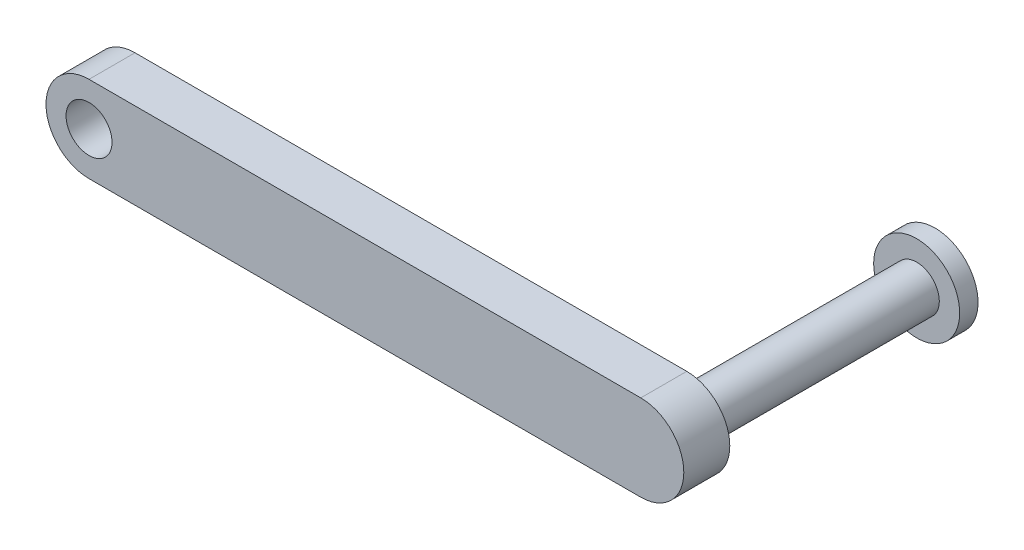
ISO-10303-21;
HEADER;
FILE_DESCRIPTION(('STEP AP214'),'2;1');
FILE_NAME('part.step','',(''),(''),'','','');
FILE_SCHEMA(('AUTOMOTIVE_DESIGN { 1 0 10303 214 1 1 1 1 }'));
ENDSEC;
DATA;
#1=APPLICATION_CONTEXT('core data for automotive mechanical design processes');
#2=APPLICATION_PROTOCOL_DEFINITION('international standard','automotive_design',2000,#1);
#3=PRODUCT_CONTEXT('',#1,'mechanical');
#4=PRODUCT('Part','Part','',(#3));
#5=PRODUCT_RELATED_PRODUCT_CATEGORY('part','',(#4));
#6=PRODUCT_DEFINITION_FORMATION('','',#4);
#7=PRODUCT_DEFINITION_CONTEXT('part definition',#1,'design');
#8=PRODUCT_DEFINITION('design','',#6,#7);
#9=PRODUCT_DEFINITION_SHAPE('','',#8);
#10=(LENGTH_UNIT() NAMED_UNIT(*) SI_UNIT(.MILLI.,.METRE.));
#11=(NAMED_UNIT(*) PLANE_ANGLE_UNIT() SI_UNIT($,.RADIAN.));
#12=(NAMED_UNIT(*) SI_UNIT($,.STERADIAN.) SOLID_ANGLE_UNIT());
#13=UNCERTAINTY_MEASURE_WITH_UNIT(LENGTH_MEASURE(1.E-05),#10,'distance_accuracy_value','');
#14=(GEOMETRIC_REPRESENTATION_CONTEXT(3) GLOBAL_UNCERTAINTY_ASSIGNED_CONTEXT((#13)) GLOBAL_UNIT_ASSIGNED_CONTEXT((#10,
#11,#12)) REPRESENTATION_CONTEXT('',''));
#15=CARTESIAN_POINT('',(0.,0.,0.));
#16=DIRECTION('',(0.,0.,1.));
#17=DIRECTION('',(1.,0.,0.));
#18=AXIS2_PLACEMENT_3D('',#15,#16,#17);
#19=CARTESIAN_POINT('',(-23.9285465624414,0.,6.35));
#20=DIRECTION('',(0.,0.,1.));
#21=DIRECTION('',(1.,0.,0.));
#22=AXIS2_PLACEMENT_3D('',#19,#20,#21);
#23=PLANE('',#22);
#24=CARTESIAN_POINT('',(-23.9285465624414,0.,6.35));
#25=DIRECTION('',(0.,0.,1.));
#26=DIRECTION('',(1.,0.,0.));
#27=AXIS2_PLACEMENT_3D('',#24,#25,#26);
#28=CIRCLE('',#27,3.175);
#29=CARTESIAN_POINT('',(-20.7535465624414,0.,6.35));
#30=VERTEX_POINT('',#29);
#31=EDGE_CURVE('E99',#30,#30,#28,.T.);
#32=ORIENTED_EDGE('',*,*,#31,.F.);
#33=EDGE_LOOP('',(#32));
#34=FACE_BOUND('',#33,.T.);
#35=CARTESIAN_POINT('',(-23.9285465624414,0.,6.35));
#36=DIRECTION('',(0.,0.,1.));
#37=DIRECTION('',(1.,0.,0.));
#38=AXIS2_PLACEMENT_3D('',#35,#36,#37);
#39=CIRCLE('',#38,5.94125643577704);
#40=CARTESIAN_POINT('',(-23.9285465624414,5.94125643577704,6.35));
#41=VERTEX_POINT('',#40);
#42=CARTESIAN_POINT('',(-23.9285465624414,-5.94125643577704,6.35));
#43=VERTEX_POINT('',#42);
#44=EDGE_CURVE('E84',#41,#43,#39,.T.);
#45=ORIENTED_EDGE('',*,*,#44,.T.);
#46=DIRECTION('',(1.,0.,0.));
#47=VECTOR('',#46,1.);
#48=CARTESIAN_POINT('',(-23.9285465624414,-5.94125643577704,6.35));
#49=LINE('',#48,#47);
#50=CARTESIAN_POINT('',(52.2714534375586,-5.94125643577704,6.35));
#51=VERTEX_POINT('',#50);
#52=EDGE_CURVE('E80',#43,#51,#49,.T.);
#53=ORIENTED_EDGE('',*,*,#52,.T.);
#54=CARTESIAN_POINT('',(52.2714534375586,0.,6.35));
#55=DIRECTION('',(0.,0.,1.));
#56=DIRECTION('',(1.,0.,0.));
#57=AXIS2_PLACEMENT_3D('',#54,#55,#56);
#58=CIRCLE('',#57,5.94125643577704);
#59=CARTESIAN_POINT('',(52.2714534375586,5.94125643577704,6.35));
#60=VERTEX_POINT('',#59);
#61=EDGE_CURVE('E82',#51,#60,#58,.T.);
#62=ORIENTED_EDGE('',*,*,#61,.T.);
#63=DIRECTION('',(-1.,0.,0.));
#64=VECTOR('',#63,1.);
#65=CARTESIAN_POINT('',(-23.9285465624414,5.94125643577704,6.35));
#66=LINE('',#65,#64);
#67=EDGE_CURVE('E50',#60,#41,#66,.T.);
#68=ORIENTED_EDGE('',*,*,#67,.T.);
#69=EDGE_LOOP('',(#45,#53,#62,#68));
#70=FACE_BOUND('',#69,.T.);
#71=ADVANCED_FACE('F33',(#34,#70),#23,.T.);
#72=CARTESIAN_POINT('',(-23.9285465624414,0.,0.));
#73=DIRECTION('',(0.,0.,1.));
#74=DIRECTION('',(1.,0.,0.));
#75=AXIS2_PLACEMENT_3D('',#72,#73,#74);
#76=PLANE('',#75);
#77=CARTESIAN_POINT('',(-23.9285465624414,0.,0.));
#78=DIRECTION('',(0.,0.,1.));
#79=DIRECTION('',(1.,0.,0.));
#80=AXIS2_PLACEMENT_3D('',#77,#78,#79);
#81=CIRCLE('',#80,5.94125643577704);
#82=CARTESIAN_POINT('',(-23.9285465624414,5.94125643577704,0.));
#83=VERTEX_POINT('',#82);
#84=CARTESIAN_POINT('',(-23.9285465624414,-5.94125643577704,0.));
#85=VERTEX_POINT('',#84);
#86=EDGE_CURVE('E96',#83,#85,#81,.T.);
#87=ORIENTED_EDGE('',*,*,#86,.F.);
#88=DIRECTION('',(-1.,0.,0.));
#89=VECTOR('',#88,1.);
#90=CARTESIAN_POINT('',(-23.9285465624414,5.94125643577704,0.));
#91=LINE('',#90,#89);
#92=CARTESIAN_POINT('',(52.2714534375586,5.94125643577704,0.));
#93=VERTEX_POINT('',#92);
#94=EDGE_CURVE('E73',#93,#83,#91,.T.);
#95=ORIENTED_EDGE('',*,*,#94,.F.);
#96=CARTESIAN_POINT('',(52.2714534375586,0.,0.));
#97=DIRECTION('',(0.,0.,1.));
#98=DIRECTION('',(1.,0.,0.));
#99=AXIS2_PLACEMENT_3D('',#96,#97,#98);
#100=CIRCLE('',#99,5.94125643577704);
#101=CARTESIAN_POINT('',(52.2714534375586,-5.94125643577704,0.));
#102=VERTEX_POINT('',#101);
#103=EDGE_CURVE('E67',#102,#93,#100,.T.);
#104=ORIENTED_EDGE('',*,*,#103,.F.);
#105=DIRECTION('',(1.,0.,0.));
#106=VECTOR('',#105,1.);
#107=CARTESIAN_POINT('',(-23.9285465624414,-5.94125643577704,0.));
#108=LINE('',#107,#106);
#109=EDGE_CURVE('E88',#85,#102,#108,.T.);
#110=ORIENTED_EDGE('',*,*,#109,.F.);
#111=EDGE_LOOP('',(#87,#95,#104,#110));
#112=FACE_BOUND('',#111,.T.);
#113=CARTESIAN_POINT('',(-23.9285465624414,0.,0.));
#114=DIRECTION('',(0.,0.,1.));
#115=DIRECTION('',(1.,0.,0.));
#116=AXIS2_PLACEMENT_3D('',#113,#114,#115);
#117=CIRCLE('',#116,3.175);
#118=CARTESIAN_POINT('',(-20.7535465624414,0.,0.));
#119=VERTEX_POINT('',#118);
#120=EDGE_CURVE('E111',#119,#119,#117,.T.);
#121=ORIENTED_EDGE('',*,*,#120,.T.);
#122=EDGE_LOOP('',(#121));
#123=FACE_BOUND('',#122,.T.);
#124=CARTESIAN_POINT('',(52.2714534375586,0.,0.));
#125=DIRECTION('',(0.,0.,1.));
#126=DIRECTION('',(1.,0.,0.));
#127=AXIS2_PLACEMENT_3D('',#124,#125,#126);
#128=CIRCLE('',#127,3.12786258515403);
#129=CARTESIAN_POINT('',(55.3993160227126,0.,0.));
#130=VERTEX_POINT('',#129);
#131=EDGE_CURVE('E114',#130,#130,#128,.T.);
#132=ORIENTED_EDGE('',*,*,#131,.T.);
#133=EDGE_LOOP('',(#132));
#134=FACE_BOUND('',#133,.T.);
#135=ADVANCED_FACE('F107',(#112,#123,#134),#76,.F.);
#136=CARTESIAN_POINT('',(-23.9285465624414,0.,6.35));
#137=DIRECTION('',(0.,0.,-1.));
#138=DIRECTION('',(-1.,0.,0.));
#139=AXIS2_PLACEMENT_3D('',#136,#137,#138);
#140=CYLINDRICAL_SURFACE('',#139,5.94125643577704);
#141=ORIENTED_EDGE('',*,*,#86,.T.);
#142=DIRECTION('',(0.,0.,-1.));
#143=VECTOR('',#142,1.);
#144=CARTESIAN_POINT('',(-23.9285465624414,-5.94125643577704,6.35));
#145=LINE('',#144,#143);
#146=EDGE_CURVE('E11',#43,#85,#145,.T.);
#147=ORIENTED_EDGE('',*,*,#146,.F.);
#148=ORIENTED_EDGE('',*,*,#44,.F.);
#149=DIRECTION('',(0.,0.,-1.));
#150=VECTOR('',#149,1.);
#151=CARTESIAN_POINT('',(-23.9285465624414,5.94125643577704,6.35));
#152=LINE('',#151,#150);
#153=EDGE_CURVE('E92',#41,#83,#152,.T.);
#154=ORIENTED_EDGE('',*,*,#153,.T.);
#155=EDGE_LOOP('',(#141,#147,#148,#154));
#156=FACE_BOUND('',#155,.T.);
#157=ADVANCED_FACE('F35',(#156),#140,.T.);
#158=CARTESIAN_POINT('',(-23.9285465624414,-5.94125643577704,6.35));
#159=DIRECTION('',(0.,1.,0.));
#160=DIRECTION('',(0.,0.,1.));
#161=AXIS2_PLACEMENT_3D('',#158,#159,#160);
#162=PLANE('',#161);
#163=ORIENTED_EDGE('',*,*,#109,.T.);
#164=DIRECTION('',(0.,0.,-1.));
#165=VECTOR('',#164,1.);
#166=CARTESIAN_POINT('',(52.2714534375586,-5.94125643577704,6.35));
#167=LINE('',#166,#165);
#168=EDGE_CURVE('E42',#51,#102,#167,.T.);
#169=ORIENTED_EDGE('',*,*,#168,.F.);
#170=ORIENTED_EDGE('',*,*,#52,.F.);
#171=ORIENTED_EDGE('',*,*,#146,.T.);
#172=EDGE_LOOP('',(#163,#169,#170,#171));
#173=FACE_BOUND('',#172,.T.);
#174=ADVANCED_FACE('F87',(#173),#162,.F.);
#175=CARTESIAN_POINT('',(52.2714534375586,0.,6.35));
#176=DIRECTION('',(0.,0.,-1.));
#177=DIRECTION('',(-1.,0.,0.));
#178=AXIS2_PLACEMENT_3D('',#175,#176,#177);
#179=CYLINDRICAL_SURFACE('',#178,5.94125643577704);
#180=ORIENTED_EDGE('',*,*,#103,.T.);
#181=DIRECTION('',(0.,0.,-1.));
#182=VECTOR('',#181,1.);
#183=CARTESIAN_POINT('',(52.2714534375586,5.94125643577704,6.35));
#184=LINE('',#183,#182);
#185=EDGE_CURVE('E89',#60,#93,#184,.T.);
#186=ORIENTED_EDGE('',*,*,#185,.F.);
#187=ORIENTED_EDGE('',*,*,#61,.F.);
#188=ORIENTED_EDGE('',*,*,#168,.T.);
#189=EDGE_LOOP('',(#180,#186,#187,#188));
#190=FACE_BOUND('',#189,.T.);
#191=ADVANCED_FACE('F90',(#190),#179,.T.);
#192=CARTESIAN_POINT('',(-23.9285465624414,5.94125643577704,6.35));
#193=DIRECTION('',(0.,-1.,0.));
#194=DIRECTION('',(0.,0.,-1.));
#195=AXIS2_PLACEMENT_3D('',#192,#193,#194);
#196=PLANE('',#195);
#197=ORIENTED_EDGE('',*,*,#94,.T.);
#198=ORIENTED_EDGE('',*,*,#153,.F.);
#199=ORIENTED_EDGE('',*,*,#67,.F.);
#200=ORIENTED_EDGE('',*,*,#185,.T.);
#201=EDGE_LOOP('',(#197,#198,#199,#200));
#202=FACE_BOUND('',#201,.T.);
#203=ADVANCED_FACE('F104',(#202),#196,.F.);
#204=CARTESIAN_POINT('',(-23.9285465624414,0.,6.35));
#205=DIRECTION('',(0.,0.,-1.));
#206=DIRECTION('',(-1.,0.,0.));
#207=AXIS2_PLACEMENT_3D('',#204,#205,#206);
#208=CYLINDRICAL_SURFACE('',#207,3.175);
#209=ORIENTED_EDGE('',*,*,#31,.T.);
#210=EDGE_LOOP('',(#209));
#211=FACE_BOUND('',#210,.T.);
#212=ORIENTED_EDGE('',*,*,#120,.F.);
#213=EDGE_LOOP('',(#212));
#214=FACE_BOUND('',#213,.T.);
#215=ADVANCED_FACE('F156',(#211,#214),#208,.F.);
#216=CARTESIAN_POINT('',(52.2714534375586,0.,-31.75));
#217=DIRECTION('',(0.,0.,1.));
#218=DIRECTION('',(1.,0.,0.));
#219=AXIS2_PLACEMENT_3D('',#216,#217,#218);
#220=CYLINDRICAL_SURFACE('',#219,3.12786258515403);
#221=CARTESIAN_POINT('',(52.2714534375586,0.,-31.75));
#222=DIRECTION('',(0.,0.,1.));
#223=DIRECTION('',(1.,0.,0.));
#224=AXIS2_PLACEMENT_3D('',#221,#222,#223);
#225=CIRCLE('',#224,3.12786258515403);
#226=CARTESIAN_POINT('',(55.3993160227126,0.,-31.75));
#227=VERTEX_POINT('',#226);
#228=EDGE_CURVE('E119',#227,#227,#225,.T.);
#229=CARTESIAN_POINT('',(55.3993160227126,0.,-31.75));
#230=CARTESIAN_POINT('',(55.3993160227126,0.,-31.4192708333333));
#231=CARTESIAN_POINT('',(55.3993160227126,0.,-31.0885416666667));
#232=CARTESIAN_POINT('',(55.3993160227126,0.,-30.4270833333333));
#233=CARTESIAN_POINT('',(55.3993160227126,0.,-30.0963541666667));
#234=CARTESIAN_POINT('',(55.3993160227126,0.,-29.4348958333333));
#235=CARTESIAN_POINT('',(55.3993160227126,0.,-29.1041666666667));
#236=CARTESIAN_POINT('',(55.3993160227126,0.,-28.4427083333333));
#237=CARTESIAN_POINT('',(55.3993160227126,0.,-28.1119791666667));
#238=CARTESIAN_POINT('',(55.3993160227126,0.,-27.4505208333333));
#239=CARTESIAN_POINT('',(55.3993160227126,0.,-27.1197916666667));
#240=CARTESIAN_POINT('',(55.3993160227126,0.,-26.4583333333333));
#241=CARTESIAN_POINT('',(55.3993160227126,0.,-26.1276041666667));
#242=CARTESIAN_POINT('',(55.3993160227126,0.,-25.4661458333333));
#243=CARTESIAN_POINT('',(55.3993160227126,0.,-25.1354166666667));
#244=CARTESIAN_POINT('',(55.3993160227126,0.,-24.4739583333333));
#245=CARTESIAN_POINT('',(55.3993160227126,0.,-24.1432291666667));
#246=CARTESIAN_POINT('',(55.3993160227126,0.,-23.4817708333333));
#247=CARTESIAN_POINT('',(55.3993160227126,0.,-23.1510416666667));
#248=CARTESIAN_POINT('',(55.3993160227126,0.,-22.4895833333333));
#249=CARTESIAN_POINT('',(55.3993160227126,0.,-22.1588541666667));
#250=CARTESIAN_POINT('',(55.3993160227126,0.,-21.4973958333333));
#251=CARTESIAN_POINT('',(55.3993160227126,0.,-21.1666666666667));
#252=CARTESIAN_POINT('',(55.3993160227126,0.,-20.5052083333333));
#253=CARTESIAN_POINT('',(55.3993160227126,0.,-20.1744791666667));
#254=CARTESIAN_POINT('',(55.3993160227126,0.,-19.5130208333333));
#255=CARTESIAN_POINT('',(55.3993160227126,0.,-19.1822916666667));
#256=CARTESIAN_POINT('',(55.3993160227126,0.,-18.5208333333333));
#257=CARTESIAN_POINT('',(55.3993160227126,0.,-18.1901041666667));
#258=CARTESIAN_POINT('',(55.3993160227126,0.,-17.5286458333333));
#259=CARTESIAN_POINT('',(55.3993160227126,0.,-17.1979166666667));
#260=CARTESIAN_POINT('',(55.3993160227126,0.,-16.5364583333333));
#261=CARTESIAN_POINT('',(55.3993160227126,0.,-16.2057291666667));
#262=CARTESIAN_POINT('',(55.3993160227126,0.,-15.5442708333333));
#263=CARTESIAN_POINT('',(55.3993160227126,0.,-15.2135416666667));
#264=CARTESIAN_POINT('',(55.3993160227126,0.,-14.5520833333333));
#265=CARTESIAN_POINT('',(55.3993160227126,0.,-14.2213541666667));
#266=CARTESIAN_POINT('',(55.3993160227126,0.,-13.5598958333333));
#267=CARTESIAN_POINT('',(55.3993160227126,0.,-13.2291666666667));
#268=CARTESIAN_POINT('',(55.3993160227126,0.,-12.5677083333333));
#269=CARTESIAN_POINT('',(55.3993160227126,0.,-12.2369791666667));
#270=CARTESIAN_POINT('',(55.3993160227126,0.,-11.5755208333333));
#271=CARTESIAN_POINT('',(55.3993160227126,0.,-11.2447916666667));
#272=CARTESIAN_POINT('',(55.3993160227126,0.,-10.5833333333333));
#273=CARTESIAN_POINT('',(55.3993160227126,0.,-10.2526041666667));
#274=CARTESIAN_POINT('',(55.3993160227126,0.,-9.59114583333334));
#275=CARTESIAN_POINT('',(55.3993160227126,0.,-9.26041666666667));
#276=CARTESIAN_POINT('',(55.3993160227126,0.,-8.59895833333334));
#277=CARTESIAN_POINT('',(55.3993160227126,0.,-8.26822916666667));
#278=CARTESIAN_POINT('',(55.3993160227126,0.,-7.60677083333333));
#279=CARTESIAN_POINT('',(55.3993160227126,0.,-7.27604166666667));
#280=CARTESIAN_POINT('',(55.3993160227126,0.,-6.61458333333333));
#281=CARTESIAN_POINT('',(55.3993160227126,0.,-6.28385416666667));
#282=CARTESIAN_POINT('',(55.3993160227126,0.,-5.62239583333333));
#283=CARTESIAN_POINT('',(55.3993160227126,0.,-5.29166666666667));
#284=CARTESIAN_POINT('',(55.3993160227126,0.,-4.63020833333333));
#285=CARTESIAN_POINT('',(55.3993160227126,0.,-4.29947916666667));
#286=CARTESIAN_POINT('',(55.3993160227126,0.,-3.63802083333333));
#287=CARTESIAN_POINT('',(55.3993160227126,0.,-3.30729166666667));
#288=CARTESIAN_POINT('',(55.3993160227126,0.,-2.64583333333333));
#289=CARTESIAN_POINT('',(55.3993160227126,0.,-2.31510416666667));
#290=CARTESIAN_POINT('',(55.3993160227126,0.,-1.65364583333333));
#291=CARTESIAN_POINT('',(55.3993160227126,0.,-1.32291666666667));
#292=CARTESIAN_POINT('',(55.3993160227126,0.,-0.661458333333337));
#293=CARTESIAN_POINT('',(55.3993160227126,0.,-0.330729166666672));
#294=CARTESIAN_POINT('',(55.3993160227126,0.,0.));
#295=B_SPLINE_CURVE_WITH_KNOTS('',3,(#229,#230,#231,#232,#233,#234,#235,#236,#237,#238,#239,
#240,#241,#242,#243,#244,#245,#246,#247,#248,#249,#250,#251,#252,#253,#254,#255,#256,#257,#258,
#259,#260,#261,#262,#263,#264,#265,#266,#267,#268,#269,#270,#271,#272,#273,#274,#275,#276,#277,
#278,#279,#280,#281,#282,#283,#284,#285,#286,#287,#288,#289,#290,#291,#292,#293,#294),
.UNSPECIFIED.,.F.,.F.,(4,2,2,2,2,2,2,2,2,2,2,2,2,2,2,2,2,2,2,2,2,2,2,2,2,2,2,2,2,2,2,2,4),(0.,
0.992187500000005,1.984375,2.97656250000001,3.96875,4.96093750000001,5.953125,6.94531250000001,
7.9375,8.92968750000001,9.921875,10.9140625,11.90625,12.8984375,13.890625,14.8828125,15.875,
16.8671875,17.859375,18.8515625,19.84375,20.8359375,21.828125,22.8203125,23.8125,24.8046875,
25.796875,26.7890625,27.78125,28.7734375,29.765625,30.7578125,31.75),.UNSPECIFIED.);
#296=EDGE_CURVE('BSEAM134',#227,#130,#295,.T.);
#297=ORIENTED_EDGE('',*,*,#228,.T.);
#298=ORIENTED_EDGE('',*,*,#131,.F.);
#299=ORIENTED_EDGE('',*,*,#296,.T.);
#300=ORIENTED_EDGE('',*,*,#296,.F.);
#301=EDGE_LOOP('',(#297,#299,#298,#300));
#302=FACE_BOUND('',#301,.T.);
#303=ADVANCED_FACE('F134',(#302),#220,.T.);
#304=CARTESIAN_POINT('',(52.2714534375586,0.,-34.29));
#305=DIRECTION('',(0.,0.,1.));
#306=DIRECTION('',(1.,0.,0.));
#307=AXIS2_PLACEMENT_3D('',#304,#305,#306);
#308=CYLINDRICAL_SURFACE('',#307,5.94125643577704);
#309=CARTESIAN_POINT('',(52.2714534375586,0.,-34.29));
#310=DIRECTION('',(0.,0.,-1.));
#311=DIRECTION('',(-1.,0.,0.));
#312=AXIS2_PLACEMENT_3D('',#309,#310,#311);
#313=CIRCLE('',#312,5.94125643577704);
#314=CARTESIAN_POINT('',(46.3301970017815,0.,-34.29));
#315=VERTEX_POINT('',#314);
#316=EDGE_CURVE('E122',#315,#315,#313,.T.);
#317=ORIENTED_EDGE('',*,*,#316,.F.);
#318=EDGE_LOOP('',(#317));
#319=FACE_BOUND('',#318,.T.);
#320=CARTESIAN_POINT('',(52.2714534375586,0.,-31.75));
#321=DIRECTION('',(0.,0.,-1.));
#322=DIRECTION('',(-1.,0.,0.));
#323=AXIS2_PLACEMENT_3D('',#320,#321,#322);
#324=CIRCLE('',#323,5.94125643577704);
#325=CARTESIAN_POINT('',(46.3301970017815,0.,-31.75));
#326=VERTEX_POINT('',#325);
#327=EDGE_CURVE('E123',#326,#326,#324,.T.);
#328=ORIENTED_EDGE('',*,*,#327,.T.);
#329=EDGE_LOOP('',(#328));
#330=FACE_BOUND('',#329,.T.);
#331=ADVANCED_FACE('F131',(#319,#330),#308,.T.);
#332=CARTESIAN_POINT('',(52.2714534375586,0.,-34.29));
#333=DIRECTION('',(0.,0.,-1.));
#334=DIRECTION('',(-1.,0.,0.));
#335=AXIS2_PLACEMENT_3D('',#332,#333,#334);
#336=PLANE('',#335);
#337=ORIENTED_EDGE('',*,*,#316,.T.);
#338=EDGE_LOOP('',(#337));
#339=FACE_BOUND('',#338,.T.);
#340=ADVANCED_FACE('F129',(#339),#336,.T.);
#341=CARTESIAN_POINT('',(52.2714534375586,0.,-31.75));
#342=DIRECTION('',(0.,0.,-1.));
#343=DIRECTION('',(-1.,0.,0.));
#344=AXIS2_PLACEMENT_3D('',#341,#342,#343);
#345=PLANE('',#344);
#346=ORIENTED_EDGE('',*,*,#228,.F.);
#347=EDGE_LOOP('',(#346));
#348=FACE_BOUND('',#347,.T.);
#349=ORIENTED_EDGE('',*,*,#327,.F.);
#350=EDGE_LOOP('',(#349));
#351=FACE_BOUND('',#350,.T.);
#352=ADVANCED_FACE('F138',(#348,#351),#345,.F.);
#353=CLOSED_SHELL('',(#71,#135,#157,#174,#191,#203,#215,#303,#331,#340,#352));
#354=MANIFOLD_SOLID_BREP('B2',#353);
#355=ADVANCED_BREP_SHAPE_REPRESENTATION('',(#18,#354),#14);
#356=SHAPE_DEFINITION_REPRESENTATION(#9,#355);
ENDSEC;
END-ISO-10303-21;
